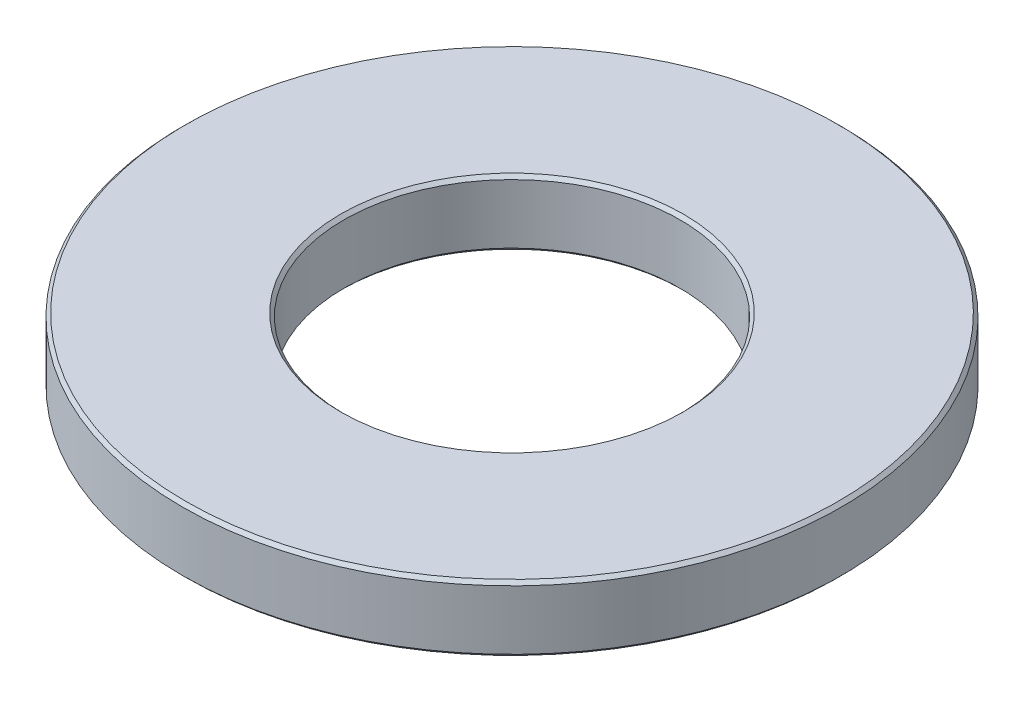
from build123d import *

# Parameters (mm, degrees)
ESQUISSE1_R          = 10
ESQUISSE1_R_2        = 5.1
BASE_EXTRUSION_DEPTH = 2
CHANFREIN1_SIZE      = 0.1


with BuildPart() as part:
    # Esquisse1 → Base-Extrusion (new body)
    with BuildSketch(Plane(origin=(0, 0, 0), x_dir=(1, 0, 0), z_dir=(0, 1, 0))):
        with Locations(Location((0, 0, 0), (0, 0, 270))):
            Circle(ESQUISSE1_R)
        with Locations(Location((0, 0, 0), (0, 0, 270))):
            Circle(ESQUISSE1_R_2, mode=Mode.SUBTRACT)
    extrude(amount=BASE_EXTRUSION_DEPTH)

    # Chanfrein1
    chanfrein1_edges = [part.edges().sort_by_distance(p)[0] for p in [
        (0, 0, -10),
        (0, 2, -10),
        (0, 0, -5.1),
        (0, 2, -5.1),
    ]]
    chamfer(chanfrein1_edges, length=CHANFREIN1_SIZE)


solid = part.part
